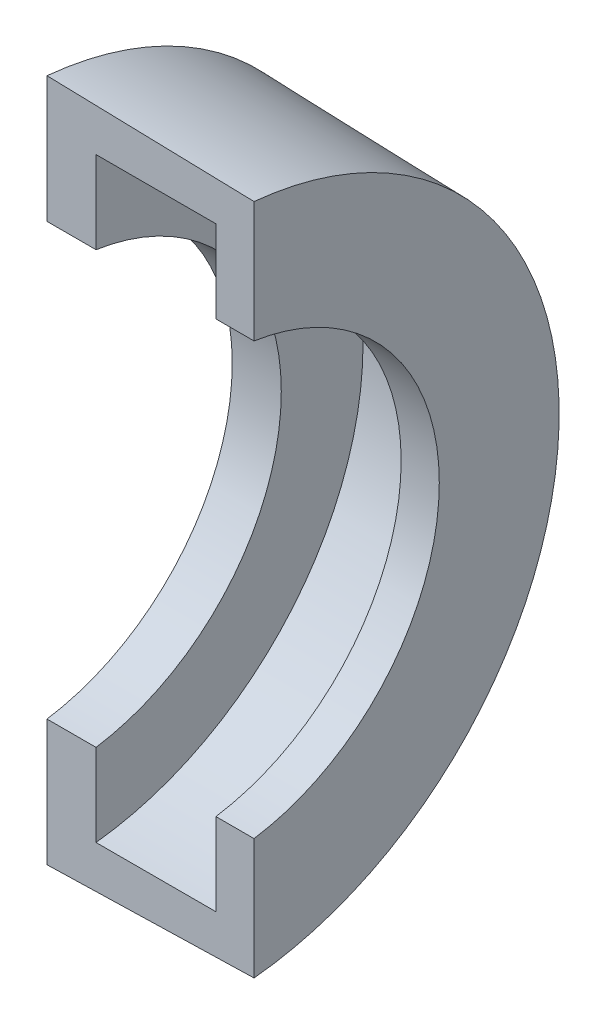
ISO-10303-21;
HEADER;
FILE_DESCRIPTION(('STEP AP214'),'2;1');
FILE_NAME('part.step','',(''),(''),'','','');
FILE_SCHEMA(('AUTOMOTIVE_DESIGN { 1 0 10303 214 1 1 1 1 }'));
ENDSEC;
DATA;
#1=APPLICATION_CONTEXT('core data for automotive mechanical design processes');
#2=APPLICATION_PROTOCOL_DEFINITION('international standard','automotive_design',2000,#1);
#3=PRODUCT_CONTEXT('',#1,'mechanical');
#4=PRODUCT('Part','Part','',(#3));
#5=PRODUCT_RELATED_PRODUCT_CATEGORY('part','',(#4));
#6=PRODUCT_DEFINITION_FORMATION('','',#4);
#7=PRODUCT_DEFINITION_CONTEXT('part definition',#1,'design');
#8=PRODUCT_DEFINITION('design','',#6,#7);
#9=PRODUCT_DEFINITION_SHAPE('','',#8);
#10=(LENGTH_UNIT() NAMED_UNIT(*) SI_UNIT(.MILLI.,.METRE.));
#11=(NAMED_UNIT(*) PLANE_ANGLE_UNIT() SI_UNIT($,.RADIAN.));
#12=(NAMED_UNIT(*) SI_UNIT($,.STERADIAN.) SOLID_ANGLE_UNIT());
#13=UNCERTAINTY_MEASURE_WITH_UNIT(LENGTH_MEASURE(1.E-05),#10,'distance_accuracy_value','');
#14=(GEOMETRIC_REPRESENTATION_CONTEXT(3) GLOBAL_UNCERTAINTY_ASSIGNED_CONTEXT((#13)) GLOBAL_UNIT_ASSIGNED_CONTEXT((#10,
#11,#12)) REPRESENTATION_CONTEXT('',''));
#15=CARTESIAN_POINT('',(0.,0.,0.));
#16=DIRECTION('',(0.,0.,1.));
#17=DIRECTION('',(1.,0.,0.));
#18=AXIS2_PLACEMENT_3D('',#15,#16,#17);
#19=CARTESIAN_POINT('',(578.076766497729,-4.9960036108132E-13,2.99999999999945));
#20=DIRECTION('',(-1.,0.,0.));
#21=DIRECTION('',(0.,-1.,0.));
#22=AXIS2_PLACEMENT_3D('',#19,#20,#21);
#23=CONICAL_SURFACE('',#22,31.,0.0261799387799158);
#24=CARTESIAN_POINT('',(507.90192915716,-32.7002675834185,-4.57966997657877E-13));
#25=CARTESIAN_POINT('',(528.192649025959,-32.1667174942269,-4.8572257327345E-13));
#26=CARTESIAN_POINT('',(548.483365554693,-31.6330404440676,-4.99600361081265E-13));
#27=CARTESIAN_POINT('',(589.064791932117,-30.5654324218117,-4.99600361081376E-13));
#28=CARTESIAN_POINT('',(609.355501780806,-30.031501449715,-4.85722573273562E-13));
#29=CARTESIAN_POINT('',(629.646208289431,-29.4974435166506,-4.57966997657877E-13));
#30=B_SPLINE_CURVE_WITH_KNOTS('',3,(#24,#25,#26,#27,#28,#29),.UNSPECIFIED.,.F.,.F.,(4,2,4),(0.,
60.8932007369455,121.786401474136),.UNSPECIFIED.);
#31=CARTESIAN_POINT('',(559.076766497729,-31.3543386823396,-4.9960036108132E-13));
#32=VERTEX_POINT('',#31);
#33=CARTESIAN_POINT('',(578.076766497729,-30.8544972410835,-4.44089209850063E-13));
#34=VERTEX_POINT('',#33);
#35=EDGE_CURVE('E11',#32,#34,#30,.T.);
#36=ORIENTED_EDGE('',*,*,#35,.F.);
#37=CARTESIAN_POINT('',(559.076766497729,-4.82253126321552E-13,2.99999999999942));
#38=DIRECTION('',(1.,0.,0.));
#39=DIRECTION('',(0.,1.,0.));
#40=AXIS2_PLACEMENT_3D('',#37,#38,#39);
#41=CIRCLE('',#40,31.4975325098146);
#42=CARTESIAN_POINT('',(559.076766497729,31.3543386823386,-6.10622663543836E-13));
#43=VERTEX_POINT('',#42);
#44=EDGE_CURVE('E100',#32,#43,#41,.T.);
#45=ORIENTED_EDGE('',*,*,#44,.T.);
#46=CARTESIAN_POINT('',(629.646208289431,29.4974435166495,-6.52256026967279E-13));
#47=CARTESIAN_POINT('',(609.355501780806,30.0315014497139,-6.40691203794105E-13));
#48=CARTESIAN_POINT('',(589.064791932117,30.5654324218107,-6.31439345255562E-13));
#49=CARTESIAN_POINT('',(548.483365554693,31.6330404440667,-6.17561557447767E-13));
#50=CARTESIAN_POINT('',(528.192649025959,32.166717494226,-6.12935628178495E-13));
#51=CARTESIAN_POINT('',(507.90192915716,32.7002675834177,-6.10622663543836E-13));
#52=B_SPLINE_CURVE_WITH_KNOTS('',3,(#46,#47,#48,#49,#50,#51),.UNSPECIFIED.,.F.,.F.,(4,2,4),(0.,
60.8932007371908,121.786401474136),.UNSPECIFIED.);
#53=CARTESIAN_POINT('',(578.076766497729,30.8544972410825,-5.82867087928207E-13));
#54=VERTEX_POINT('',#53);
#55=EDGE_CURVE('E42',#54,#43,#52,.T.);
#56=ORIENTED_EDGE('',*,*,#55,.F.);
#57=CARTESIAN_POINT('',(578.076766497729,-4.9960036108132E-13,2.99999999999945));
#58=DIRECTION('',(1.,0.,0.));
#59=DIRECTION('',(0.,1.,0.));
#60=AXIS2_PLACEMENT_3D('',#57,#58,#59);
#61=CIRCLE('',#60,31.);
#62=EDGE_CURVE('E107',#34,#54,#61,.T.);
#63=ORIENTED_EDGE('',*,*,#62,.F.);
#64=EDGE_LOOP('',(#36,#45,#56,#63));
#65=FACE_BOUND('',#64,.T.);
#66=CARTESIAN_POINT('',(562.524521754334,-1.06900935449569,-28.3890516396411));
#67=CARTESIAN_POINT('',(562.464524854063,-1.00994823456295,-28.3926348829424));
#68=CARTESIAN_POINT('',(562.409465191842,-0.945779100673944,-28.3960951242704));
#69=CARTESIAN_POINT('',(562.310839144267,-0.809042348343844,-28.4024996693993));
#70=CARTESIAN_POINT('',(562.267286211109,-0.736465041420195,-28.4054433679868));
#71=CARTESIAN_POINT('',(562.192985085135,-0.585027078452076,-28.4105749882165));
#72=CARTESIAN_POINT('',(562.162232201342,-0.506168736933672,-28.4127631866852));
#73=CARTESIAN_POINT('',(562.114407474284,-0.344410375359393,-28.416205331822));
#74=CARTESIAN_POINT('',(562.097332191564,-0.261511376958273,-28.4174595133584));
#75=CARTESIAN_POINT('',(562.077358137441,-0.0941519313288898,-28.4189294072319));
#76=CARTESIAN_POINT('',(562.074436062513,-0.00969428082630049,-28.4191468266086));
#77=CARTESIAN_POINT('',(562.082790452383,0.158514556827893,-28.4185297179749));
#78=CARTESIAN_POINT('',(562.094067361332,0.24226572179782,-28.4176951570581));
#79=CARTESIAN_POINT('',(562.130475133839,0.406590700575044,-28.4150446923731));
#80=CARTESIAN_POINT('',(562.155591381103,0.487167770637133,-28.4132298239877));
#81=CARTESIAN_POINT('',(562.218947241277,0.642960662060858,-28.408768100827));
#82=CARTESIAN_POINT('',(562.257186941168,0.718176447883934,-28.4061212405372));
#83=CARTESIAN_POINT('',(562.345769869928,0.861241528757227,-28.4002036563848));
#84=CARTESIAN_POINT('',(562.396131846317,0.92907917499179,-28.3969319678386));
#85=CARTESIAN_POINT('',(562.507499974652,1.05534636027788,-28.3900237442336));
#86=CARTESIAN_POINT('',(562.568506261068,1.11377578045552,-28.386387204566));
#87=CARTESIAN_POINT('',(562.699593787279,1.21970716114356,-28.3790143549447));
#88=CARTESIAN_POINT('',(562.769695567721,1.26718369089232,-28.3752778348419));
#89=CARTESIAN_POINT('',(562.916883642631,1.34969356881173,-28.3679791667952));
#90=CARTESIAN_POINT('',(562.993969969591,1.38472685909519,-28.3644170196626));
#91=CARTESIAN_POINT('',(563.152989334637,1.44136751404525,-28.3576968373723));
#92=CARTESIAN_POINT('',(563.234924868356,1.46296789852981,-28.3545390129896));
#93=CARTESIAN_POINT('',(563.401280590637,1.49209085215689,-28.3488056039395));
#94=CARTESIAN_POINT('',(563.485700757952,1.49961354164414,-28.3462300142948));
#95=CARTESIAN_POINT('',(563.654507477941,1.50035686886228,-28.3417690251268));
#96=CARTESIAN_POINT('',(563.738893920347,1.49359693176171,-28.3398826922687));
#97=CARTESIAN_POINT('',(563.905345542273,1.46599884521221,-28.336822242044));
#98=CARTESIAN_POINT('',(563.987410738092,1.44516079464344,-28.3356481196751));
#99=CARTESIAN_POINT('',(564.14678342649,1.39002944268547,-28.3339644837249));
#100=CARTESIAN_POINT('',(564.224096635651,1.3557526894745,-28.3334541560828));
#101=CARTESIAN_POINT('',(564.371878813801,1.27471490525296,-28.3329823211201));
#102=CARTESIAN_POINT('',(564.442347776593,1.22795386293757,-28.3330208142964));
#103=CARTESIAN_POINT('',(564.574449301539,1.12326857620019,-28.3334866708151));
#104=CARTESIAN_POINT('',(564.636080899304,1.06534311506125,-28.3339140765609));
#105=CARTESIAN_POINT('',(564.74875225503,0.939974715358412,-28.3349735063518));
#106=CARTESIAN_POINT('',(564.799791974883,0.872531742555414,-28.3356055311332));
#107=CARTESIAN_POINT('',(564.889862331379,0.729993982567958,-28.3368907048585));
#108=CARTESIAN_POINT('',(564.928885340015,0.654894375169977,-28.3375438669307));
#109=CARTESIAN_POINT('',(564.993771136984,0.499209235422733,-28.3387110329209));
#110=CARTESIAN_POINT('',(565.019633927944,0.418623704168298,-28.3392250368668));
#111=CARTESIAN_POINT('',(565.057466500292,0.254245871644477,-28.3399988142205));
#112=CARTESIAN_POINT('',(565.069435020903,0.17045328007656,-28.3402585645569));
#113=CARTESIAN_POINT('',(565.079134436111,0.00204771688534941,-28.3404680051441));
#114=CARTESIAN_POINT('',(565.076865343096,-0.0825652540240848,-28.3404176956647));
#115=CARTESIAN_POINT('',(565.058156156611,-0.250190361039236,-28.3400177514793));
#116=CARTESIAN_POINT('',(565.041719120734,-0.33320283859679,-28.3396681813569));
#117=CARTESIAN_POINT('',(564.995145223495,-0.495289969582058,-28.3387455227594));
#118=CARTESIAN_POINT('',(564.965008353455,-0.574364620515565,-28.3381724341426));
#119=CARTESIAN_POINT('',(564.891885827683,-0.726342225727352,-28.3369338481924));
#120=CARTESIAN_POINT('',(564.84889864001,-0.799244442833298,-28.3362683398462));
#121=CARTESIAN_POINT('',(564.751295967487,-0.936799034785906,-28.3350150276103));
#122=CARTESIAN_POINT('',(564.69668044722,-1.00145138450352,-28.3344272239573));
#123=CARTESIAN_POINT('',(564.577362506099,-1.12067903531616,-28.333516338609));
#124=CARTESIAN_POINT('',(564.512658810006,-1.17525306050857,-28.3331932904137));
#125=CARTESIAN_POINT('',(564.375006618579,-1.27276342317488,-28.3329916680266));
#126=CARTESIAN_POINT('',(564.302058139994,-1.31569978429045,-28.3331130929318));
#127=CARTESIAN_POINT('',(564.150025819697,-1.38869763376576,-28.3339478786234));
#128=CARTESIAN_POINT('',(564.070944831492,-1.41876506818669,-28.3346609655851));
#129=CARTESIAN_POINT('',(563.908870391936,-1.46520054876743,-28.3367728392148));
#130=CARTESIAN_POINT('',(563.825877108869,-1.48156918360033,-28.3381715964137));
#131=CARTESIAN_POINT('',(563.658386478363,-1.50014463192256,-28.3416788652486));
#132=CARTESIAN_POINT('',(563.573890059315,-1.50235990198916,-28.34378695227));
#133=CARTESIAN_POINT('',(563.405718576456,-1.49259424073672,-28.3486621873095));
#134=CARTESIAN_POINT('',(563.322043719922,-1.48060981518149,-28.351429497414));
#135=CARTESIAN_POINT('',(563.157816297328,-1.44277259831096,-28.3574984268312));
#136=CARTESIAN_POINT('',(563.077267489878,-1.41690363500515,-28.3608006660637));
#137=CARTESIAN_POINT('',(562.921731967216,-1.35204062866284,-28.3677403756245));
#138=CARTESIAN_POINT('',(562.846738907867,-1.31306184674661,-28.3713774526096));
#139=CARTESIAN_POINT('',(562.730338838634,-1.23952888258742,-28.3773997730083));
#140=CARTESIAN_POINT('',(562.686643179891,-1.20852912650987,-28.3797587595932));
#141=CARTESIAN_POINT('',(562.602807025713,-1.14204428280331,-28.3844456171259));
#142=CARTESIAN_POINT('',(562.562666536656,-1.10655918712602,-28.386773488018));
#143=CARTESIAN_POINT('',(562.524521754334,-1.06900935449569,-28.3890516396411));
#144=B_SPLINE_CURVE_WITH_KNOTS('',3,(#66,#67,#68,#69,#70,#71,#72,#73,#74,#75,#76,#77,#78,#79,
#80,#81,#82,#83,#84,#85,#86,#87,#88,#89,#90,#91,#92,#93,#94,#95,#96,#97,#98,#99,#100,#101,#102,
#103,#104,#105,#106,#107,#108,#109,#110,#111,#112,#113,#114,#115,#116,#117,#118,#119,#120,#121,
#122,#123,#124,#125,#126,#127,#128,#129,#130,#131,#132,#133,#134,#135,#136,#137,#138,#139,#140,
#141,#142,#143),.UNSPECIFIED.,.T.,.F.,(4,2,2,2,2,2,2,2,2,2,2,2,2,2,2,2,2,2,2,2,2,2,2,2,2,2,2,2,
2,2,2,2,2,2,2,2,2,2,4),(0.,0.252601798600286,0.50549761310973,0.758300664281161,
1.01104012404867,1.26336330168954,1.51569437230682,1.76775945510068,2.01982620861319,
2.27228532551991,2.52474763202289,2.77779034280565,3.03083423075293,3.28400949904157,
3.53718260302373,3.79001159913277,4.04283881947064,4.29535568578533,4.54787278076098,
4.80041741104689,5.05296294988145,5.30566847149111,5.55837394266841,5.8111023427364,
6.06383052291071,6.31650417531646,6.56917798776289,6.82188193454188,7.07458665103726,
7.32732333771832,7.58005951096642,7.83267878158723,8.08528719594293,8.33774466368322,
8.59026426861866,8.84307863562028,9.09559971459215,9.25619840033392,9.41679737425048),.UNSPECIFIED.);
#145=CARTESIAN_POINT('',(562.524521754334,-1.06900935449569,-28.3890516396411));
#146=VERTEX_POINT('',#145);
#147=EDGE_CURVE('E241',#146,#146,#144,.T.);
#148=ORIENTED_EDGE('',*,*,#147,.F.);
#149=EDGE_LOOP('',(#148));
#150=FACE_BOUND('',#149,.T.);
#151=ADVANCED_FACE('F29',(#65,#150),#23,.T.);
#152=CARTESIAN_POINT('',(669.262298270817,45.3544972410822,-7.07767178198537E-13));
#153=DIRECTION('',(0.,0.,-1.));
#154=DIRECTION('',(0.,1.,0.));
#155=AXIS2_PLACEMENT_3D('',#152,#153,#154);
#156=PLANE('',#155);
#157=ORIENTED_EDGE('',*,*,#35,.T.);
#158=DIRECTION('',(0.,1.,0.));
#159=VECTOR('',#158,1.);
#160=CARTESIAN_POINT('',(578.076766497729,-31.0000000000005,-4.44089209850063E-13));
#161=LINE('',#160,#159);
#162=CARTESIAN_POINT('',(578.076766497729,-19.7737199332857,-4.85722573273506E-13));
#163=VERTEX_POINT('',#162);
#164=EDGE_CURVE('E266',#34,#163,#161,.T.);
#165=ORIENTED_EDGE('',*,*,#164,.T.);
#166=DIRECTION('',(1.,0.,0.));
#167=VECTOR('',#166,1.);
#168=CARTESIAN_POINT('',(589.521731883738,-19.7737199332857,-5.82867087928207E-13));
#169=LINE('',#168,#167);
#170=CARTESIAN_POINT('',(574.576766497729,-19.7737199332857,-5.68989300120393E-13));
#171=VERTEX_POINT('',#170);
#172=EDGE_CURVE('E56',#163,#171,#169,.F.);
#173=ORIENTED_EDGE('',*,*,#172,.T.);
#174=DIRECTION('',(0.,-1.,0.));
#175=VECTOR('',#174,1.);
#176=CARTESIAN_POINT('',(574.576766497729,-20.0000000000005,-5.68989300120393E-13));
#177=LINE('',#176,#175);
#178=CARTESIAN_POINT('',(574.576766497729,-27.3358738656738,-5.41233724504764E-13));
#179=VERTEX_POINT('',#178);
#180=EDGE_CURVE('E263',#171,#179,#177,.T.);
#181=ORIENTED_EDGE('',*,*,#180,.T.);
#182=DIRECTION('',(1.,0.,0.));
#183=VECTOR('',#182,1.);
#184=CARTESIAN_POINT('',(589.521731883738,-27.3358738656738,-5.55111512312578E-13));
#185=LINE('',#184,#183);
#186=CARTESIAN_POINT('',(563.576766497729,-27.3358738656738,-4.85722573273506E-13));
#187=VERTEX_POINT('',#186);
#188=EDGE_CURVE('E270',#179,#187,#185,.F.);
#189=ORIENTED_EDGE('',*,*,#188,.T.);
#190=DIRECTION('',(0.,1.,0.));
#191=VECTOR('',#190,1.);
#192=CARTESIAN_POINT('',(563.576766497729,-27.5000000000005,-4.02455846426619E-13));
#193=LINE('',#192,#191);
#194=CARTESIAN_POINT('',(563.576766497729,-19.7737199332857,-4.57966997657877E-13));
#195=VERTEX_POINT('',#194);
#196=EDGE_CURVE('E256',#187,#195,#193,.T.);
#197=ORIENTED_EDGE('',*,*,#196,.T.);
#198=DIRECTION('',(1.,0.,0.));
#199=VECTOR('',#198,1.);
#200=CARTESIAN_POINT('',(589.521731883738,-19.7737199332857,-5.82867087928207E-13));
#201=LINE('',#200,#199);
#202=CARTESIAN_POINT('',(559.076766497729,-19.7737199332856,-5.41233724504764E-13));
#203=VERTEX_POINT('',#202);
#204=EDGE_CURVE('E267',#195,#203,#201,.F.);
#205=ORIENTED_EDGE('',*,*,#204,.T.);
#206=DIRECTION('',(0.,-1.,0.));
#207=VECTOR('',#206,1.);
#208=CARTESIAN_POINT('',(559.076766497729,-31.497532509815,-4.9960036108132E-13));
#209=LINE('',#208,#207);
#210=EDGE_CURVE('E119',#203,#32,#209,.T.);
#211=ORIENTED_EDGE('',*,*,#210,.T.);
#212=EDGE_LOOP('',(#157,#165,#173,#181,#189,#197,#205,#211));
#213=FACE_BOUND('',#212,.T.);
#214=ADVANCED_FACE('F136',(#213),#156,.F.);
#215=CARTESIAN_POINT('',(578.076766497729,-31.0000000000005,2.99999999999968));
#216=DIRECTION('',(1.,0.,0.));
#217=DIRECTION('',(0.,1.,0.));
#218=AXIS2_PLACEMENT_3D('',#215,#216,#217);
#219=PLANE('',#218);
#220=ORIENTED_EDGE('',*,*,#164,.F.);
#221=ORIENTED_EDGE('',*,*,#62,.T.);
#222=CARTESIAN_POINT('',(578.076766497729,19.7737199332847,-5.41233724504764E-13));
#223=VERTEX_POINT('',#222);
#224=EDGE_CURVE('E49',#223,#54,#161,.T.);
#225=ORIENTED_EDGE('',*,*,#224,.F.);
#226=CARTESIAN_POINT('',(578.076766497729,-4.9960036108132E-13,2.99999999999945));
#227=DIRECTION('',(1.,0.,0.));
#228=DIRECTION('',(0.,1.,0.));
#229=AXIS2_PLACEMENT_3D('',#226,#227,#228);
#230=CIRCLE('',#229,20.);
#231=EDGE_CURVE('E122',#163,#223,#230,.T.);
#232=ORIENTED_EDGE('',*,*,#231,.F.);
#233=EDGE_LOOP('',(#220,#221,#225,#232));
#234=FACE_BOUND('',#233,.T.);
#235=ADVANCED_FACE('F140',(#234),#219,.T.);
#236=CARTESIAN_POINT('',(589.521731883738,-5.03069808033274E-13,2.99999999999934));
#237=DIRECTION('',(1.,0.,0.));
#238=DIRECTION('',(0.,1.,0.));
#239=AXIS2_PLACEMENT_3D('',#236,#237,#238);
#240=CYLINDRICAL_SURFACE('',#239,20.);
#241=DIRECTION('',(1.,0.,0.));
#242=VECTOR('',#241,1.);
#243=CARTESIAN_POINT('',(589.521731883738,19.7737199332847,-7.35522753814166E-13));
#244=LINE('',#243,#242);
#245=CARTESIAN_POINT('',(574.576766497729,19.7737199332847,-6.10622663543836E-13));
#246=VERTEX_POINT('',#245);
#247=EDGE_CURVE('E262',#246,#223,#244,.T.);
#248=ORIENTED_EDGE('',*,*,#247,.F.);
#249=CARTESIAN_POINT('',(574.57676649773,-4.85722573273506E-13,2.99999999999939));
#250=DIRECTION('',(1.,0.,0.));
#251=DIRECTION('',(0.,1.,0.));
#252=AXIS2_PLACEMENT_3D('',#249,#250,#251);
#253=CIRCLE('',#252,20.);
#254=EDGE_CURVE('E123',#171,#246,#253,.T.);
#255=ORIENTED_EDGE('',*,*,#254,.F.);
#256=ORIENTED_EDGE('',*,*,#172,.F.);
#257=ORIENTED_EDGE('',*,*,#231,.T.);
#258=EDGE_LOOP('',(#248,#255,#256,#257));
#259=FACE_BOUND('',#258,.T.);
#260=ADVANCED_FACE('F31',(#259),#240,.F.);
#261=CARTESIAN_POINT('',(574.576766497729,-20.0000000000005,2.99999999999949));
#262=DIRECTION('',(-1.,0.,0.));
#263=DIRECTION('',(0.,-1.,0.));
#264=AXIS2_PLACEMENT_3D('',#261,#262,#263);
#265=PLANE('',#264);
#266=CARTESIAN_POINT('',(574.576766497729,27.3358738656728,-6.66133814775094E-13));
#267=VERTEX_POINT('',#266);
#268=EDGE_CURVE('E259',#267,#246,#177,.T.);
#269=ORIENTED_EDGE('',*,*,#268,.F.);
#270=CARTESIAN_POINT('',(574.57676649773,-4.85722573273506E-13,2.99999999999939));
#271=DIRECTION('',(1.,0.,0.));
#272=DIRECTION('',(0.,1.,0.));
#273=AXIS2_PLACEMENT_3D('',#270,#271,#272);
#274=CIRCLE('',#273,27.5);
#275=EDGE_CURVE('E282',#179,#267,#274,.T.);
#276=ORIENTED_EDGE('',*,*,#275,.F.);
#277=ORIENTED_EDGE('',*,*,#180,.F.);
#278=ORIENTED_EDGE('',*,*,#254,.T.);
#279=EDGE_LOOP('',(#269,#276,#277,#278));
#280=FACE_BOUND('',#279,.T.);
#281=ADVANCED_FACE('F147',(#280),#265,.T.);
#282=CARTESIAN_POINT('',(589.521731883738,-5.03069808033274E-13,2.99999999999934));
#283=DIRECTION('',(1.,0.,0.));
#284=DIRECTION('',(0.,1.,0.));
#285=AXIS2_PLACEMENT_3D('',#282,#283,#284);
#286=CYLINDRICAL_SURFACE('',#285,27.5);
#287=DIRECTION('',(1.,0.,0.));
#288=VECTOR('',#287,1.);
#289=CARTESIAN_POINT('',(589.521731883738,27.3358738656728,-7.07767178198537E-13));
#290=LINE('',#289,#288);
#291=CARTESIAN_POINT('',(563.576766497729,27.3358738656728,-5.82867087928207E-13));
#292=VERTEX_POINT('',#291);
#293=EDGE_CURVE('E255',#292,#267,#290,.T.);
#294=ORIENTED_EDGE('',*,*,#293,.F.);
#295=CARTESIAN_POINT('',(563.576766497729,-4.71844785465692E-13,2.99999999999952));
#296=DIRECTION('',(1.,0.,0.));
#297=DIRECTION('',(0.,1.,0.));
#298=AXIS2_PLACEMENT_3D('',#295,#296,#297);
#299=CIRCLE('',#298,27.5);
#300=EDGE_CURVE('E279',#187,#292,#299,.T.);
#301=ORIENTED_EDGE('',*,*,#300,.F.);
#302=ORIENTED_EDGE('',*,*,#188,.F.);
#303=ORIENTED_EDGE('',*,*,#275,.T.);
#304=EDGE_LOOP('',(#294,#301,#302,#303));
#305=FACE_BOUND('',#304,.T.);
#306=ADVANCED_FACE('F178',(#305),#286,.F.);
#307=CARTESIAN_POINT('',(563.576766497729,-27.5000000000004,2.99999999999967));
#308=DIRECTION('',(1.,0.,0.));
#309=DIRECTION('',(0.,1.,0.));
#310=AXIS2_PLACEMENT_3D('',#307,#308,#309);
#311=PLANE('',#310);
#312=ORIENTED_EDGE('',*,*,#196,.F.);
#313=ORIENTED_EDGE('',*,*,#300,.T.);
#314=CARTESIAN_POINT('',(563.576766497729,19.7737199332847,-5.27355936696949E-13));
#315=VERTEX_POINT('',#314);
#316=EDGE_CURVE('E252',#315,#292,#193,.T.);
#317=ORIENTED_EDGE('',*,*,#316,.F.);
#318=CARTESIAN_POINT('',(563.576766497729,-4.71844785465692E-13,2.99999999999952));
#319=DIRECTION('',(1.,0.,0.));
#320=DIRECTION('',(0.,1.,0.));
#321=AXIS2_PLACEMENT_3D('',#318,#319,#320);
#322=CIRCLE('',#321,20.);
#323=EDGE_CURVE('E276',#195,#315,#322,.T.);
#324=ORIENTED_EDGE('',*,*,#323,.F.);
#325=EDGE_LOOP('',(#312,#313,#317,#324));
#326=FACE_BOUND('',#325,.T.);
#327=ADVANCED_FACE('F187',(#326),#311,.T.);
#328=CARTESIAN_POINT('',(589.521731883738,-5.03069808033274E-13,2.99999999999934));
#329=DIRECTION('',(1.,0.,0.));
#330=DIRECTION('',(0.,1.,0.));
#331=AXIS2_PLACEMENT_3D('',#328,#329,#330);
#332=CYLINDRICAL_SURFACE('',#331,20.);
#333=DIRECTION('',(1.,0.,0.));
#334=VECTOR('',#333,1.);
#335=CARTESIAN_POINT('',(589.521731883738,19.7737199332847,-7.35522753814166E-13));
#336=LINE('',#335,#334);
#337=CARTESIAN_POINT('',(559.076766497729,19.7737199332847,-5.82867087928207E-13));
#338=VERTEX_POINT('',#337);
#339=EDGE_CURVE('E116',#338,#315,#336,.T.);
#340=ORIENTED_EDGE('',*,*,#339,.F.);
#341=CARTESIAN_POINT('',(559.076766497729,-4.82253126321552E-13,2.99999999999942));
#342=DIRECTION('',(1.,0.,0.));
#343=DIRECTION('',(0.,1.,0.));
#344=AXIS2_PLACEMENT_3D('',#341,#342,#343);
#345=CIRCLE('',#344,20.);
#346=EDGE_CURVE('E106',#203,#338,#345,.T.);
#347=ORIENTED_EDGE('',*,*,#346,.F.);
#348=ORIENTED_EDGE('',*,*,#204,.F.);
#349=ORIENTED_EDGE('',*,*,#323,.T.);
#350=EDGE_LOOP('',(#340,#347,#348,#349));
#351=FACE_BOUND('',#350,.T.);
#352=ADVANCED_FACE('F197',(#351),#332,.F.);
#353=CARTESIAN_POINT('',(559.076766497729,-31.497532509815,2.99999999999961));
#354=DIRECTION('',(-1.,0.,0.));
#355=DIRECTION('',(0.,-1.,0.));
#356=AXIS2_PLACEMENT_3D('',#353,#354,#355);
#357=PLANE('',#356);
#358=EDGE_CURVE('E111',#43,#338,#209,.T.);
#359=ORIENTED_EDGE('',*,*,#358,.F.);
#360=ORIENTED_EDGE('',*,*,#44,.F.);
#361=ORIENTED_EDGE('',*,*,#210,.F.);
#362=ORIENTED_EDGE('',*,*,#346,.T.);
#363=EDGE_LOOP('',(#359,#360,#361,#362));
#364=FACE_BOUND('',#363,.T.);
#365=ADVANCED_FACE('F112',(#364),#357,.T.);
#366=ORIENTED_EDGE('',*,*,#247,.T.);
#367=ORIENTED_EDGE('',*,*,#224,.T.);
#368=ORIENTED_EDGE('',*,*,#55,.T.);
#369=ORIENTED_EDGE('',*,*,#358,.T.);
#370=ORIENTED_EDGE('',*,*,#339,.T.);
#371=ORIENTED_EDGE('',*,*,#316,.T.);
#372=ORIENTED_EDGE('',*,*,#293,.T.);
#373=ORIENTED_EDGE('',*,*,#268,.T.);
#374=EDGE_LOOP('',(#366,#367,#368,#369,#370,#371,#372,#373));
#375=FACE_BOUND('',#374,.T.);
#376=ADVANCED_FACE('F121',(#375),#156,.F.);
#377=CARTESIAN_POINT('',(563.576766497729,-5.34294830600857E-13,-30.0000000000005));
#378=DIRECTION('',(0.,0.,1.));
#379=DIRECTION('',(1.,0.,0.));
#380=AXIS2_PLACEMENT_3D('',#377,#378,#379);
#381=PLANE('',#380);
#382=CARTESIAN_POINT('',(563.576766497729,-5.34294830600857E-13,-30.0000000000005));
#383=DIRECTION('',(0.,0.,1.));
#384=DIRECTION('',(1.,0.,0.));
#385=AXIS2_PLACEMENT_3D('',#382,#383,#384);
#386=CIRCLE('',#385,1.49999999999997);
#387=CARTESIAN_POINT('',(565.076766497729,-5.35566859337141E-13,-30.0000000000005));
#388=VERTEX_POINT('',#387);
#389=EDGE_CURVE('E117',#388,#388,#386,.T.);
#390=ORIENTED_EDGE('',*,*,#389,.F.);
#391=EDGE_LOOP('',(#390));
#392=FACE_BOUND('',#391,.T.);
#393=ADVANCED_FACE('F135',(#392),#381,.F.);
#394=CARTESIAN_POINT('',(563.576766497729,-5.44703171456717E-13,0.000999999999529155));
#395=DIRECTION('',(0.,0.,-1.));
#396=DIRECTION('',(-1.,0.,0.));
#397=AXIS2_PLACEMENT_3D('',#394,#395,#396);
#398=CYLINDRICAL_SURFACE('',#397,1.49999999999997);
#399=ORIENTED_EDGE('',*,*,#147,.T.);
#400=EDGE_LOOP('',(#399));
#401=FACE_BOUND('',#400,.T.);
#402=ORIENTED_EDGE('',*,*,#389,.T.);
#403=EDGE_LOOP('',(#402));
#404=FACE_BOUND('',#403,.T.);
#405=ADVANCED_FACE('F137',(#401,#404),#398,.T.);
#406=CLOSED_SHELL('',(#151,#214,#235,#260,#281,#306,#327,#352,#365,#376,#393,#405));
#407=MANIFOLD_SOLID_BREP('B2',#406);
#408=ADVANCED_BREP_SHAPE_REPRESENTATION('',(#18,#407),#14);
#409=SHAPE_DEFINITION_REPRESENTATION(#9,#408);
ENDSEC;
END-ISO-10303-21;
